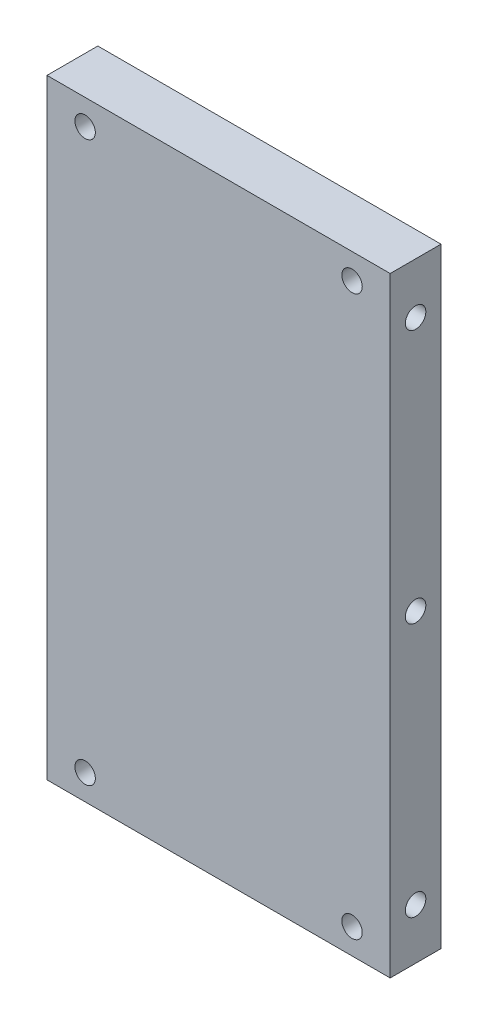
from build123d import *

# Parameters (mm, degrees)
SKETCH1_W                        = 85.725
SKETCH1_H                        = 152.4
EXTRUDE1_DEPTH                   = 12.7
F_1_4_20_TAPPED_HOLE1_D          = 5.1054
F_1_4_20_TAPPED_HOLE2_AT_2_COUNT = 2
F_1_4_20_TAPPED_HOLE2_AT_2_PITCH = 63.5
F_1_4_20_TAPPED_HOLE2_AT_3_COUNT = 2
F_1_4_20_TAPPED_HOLE2_AT_3_PITCH = 127


with BuildPart() as part:
    # Sketch1 → Extrude1 (new body)
    with BuildSketch(Plane.XY):
        with Locations((42.8625, 76.2)):
            Rectangle(SKETCH1_W, SKETCH1_H)
    extrude(amount=EXTRUDE1_DEPTH)

    # 1_4-20 Tapped Hole1 (through all)
    with Locations(Plane(origin=(9.525, 6.35, 12.7), x_dir=(1, 0, 0), z_dir=(0, 0, 1))):
        with Locations((0, 0), (66.675, 0), (0, 139.7), (66.675, 139.7)):
            Hole(F_1_4_20_TAPPED_HOLE1_D / 2)

    # Sketch4 → 1_4-20 Tapped Hole2 (revolve, cut)
    with BuildSketch(Plane(origin=(0, 139.7, 6.35), x_dir=(0, 0, 1), z_dir=(0, 1, 0))):
        Polygon((0, 0), (0, 23.123816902), (2.5527, 21.59), (2.5527, 0), align=None)
    f_1_4_20_tapped_hole2 = revolve(axis=Axis((-6.35, 139.7, 6.35), (1, 0, 0)), mode=Mode.SUBTRACT)

    # 1_4-20 Tapped Hole2 at 2: 1_4-20 Tapped Hole2 ×2
    with Locations(*[(0, -i * F_1_4_20_TAPPED_HOLE2_AT_2_PITCH, 0) for i in range(1, F_1_4_20_TAPPED_HOLE2_AT_2_COUNT)]):
        add(f_1_4_20_tapped_hole2, mode=Mode.SUBTRACT)

    # 1_4-20 Tapped Hole2 at 3: 1_4-20 Tapped Hole2 ×2
    with Locations(*[(0, -i * F_1_4_20_TAPPED_HOLE2_AT_3_PITCH, 0) for i in range(1, F_1_4_20_TAPPED_HOLE2_AT_3_COUNT)]):
        add(f_1_4_20_tapped_hole2, mode=Mode.SUBTRACT)

    # Mirror1: 1_4-20 Tapped Hole2 across plane
    add(f_1_4_20_tapped_hole2.mirror(Plane(origin=(42.8625, 0, 0), x_dir=(0, 0, 1), z_dir=(1, 0, 0))), mode=Mode.SUBTRACT)

    # Mirror1 copy 1 sketch → Mirror1 copy 1 (revolve, cut)
    with BuildSketch(Plane(origin=(85.725, 76.2, 6.35), x_dir=(0, 0, 1), z_dir=(0, 1, 0))):
        Polygon((0, 0), (0, -23.123816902), (2.5527, -21.59), (2.5527, 0), align=None)
    revolve(axis=Axis((92.075, 76.2, 6.35), (1, 0, 0)), mode=Mode.SUBTRACT)

    # Mirror1 copy 2 sketch → Mirror1 copy 2 (revolve, cut)
    with BuildSketch(Plane(origin=(85.725, 12.7, 6.35), x_dir=(0, 0, 1), z_dir=(0, 1, 0))):
        Polygon((0, 0), (0, -23.123816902), (2.5527, -21.59), (2.5527, 0), align=None)
    revolve(axis=Axis((92.075, 12.7, 6.35), (1, 0, 0)), mode=Mode.SUBTRACT)


solid = part.part
